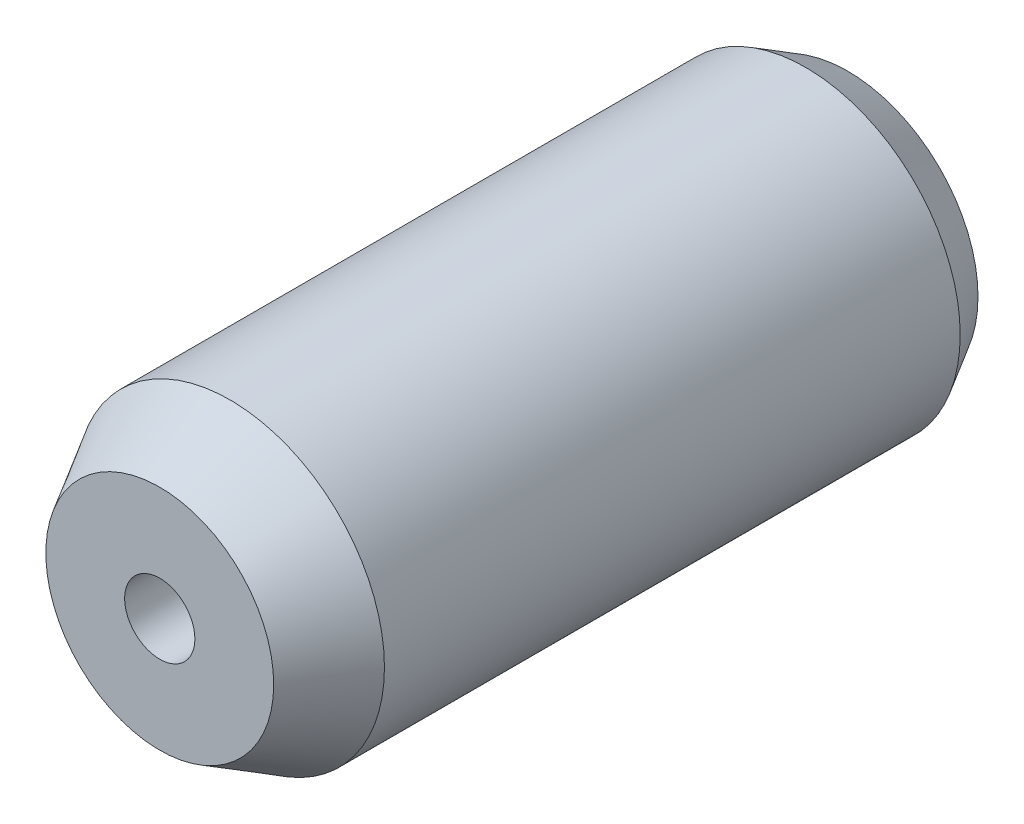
ISO-10303-21;
HEADER;
FILE_DESCRIPTION(('STEP AP214'),'2;1');
FILE_NAME('part.step','',(''),(''),'','','');
FILE_SCHEMA(('AUTOMOTIVE_DESIGN { 1 0 10303 214 1 1 1 1 }'));
ENDSEC;
DATA;
#1=APPLICATION_CONTEXT('core data for automotive mechanical design processes');
#2=APPLICATION_PROTOCOL_DEFINITION('international standard','automotive_design',2000,#1);
#3=PRODUCT_CONTEXT('',#1,'mechanical');
#4=PRODUCT('Part','Part','',(#3));
#5=PRODUCT_RELATED_PRODUCT_CATEGORY('part','',(#4));
#6=PRODUCT_DEFINITION_FORMATION('','',#4);
#7=PRODUCT_DEFINITION_CONTEXT('part definition',#1,'design');
#8=PRODUCT_DEFINITION('design','',#6,#7);
#9=PRODUCT_DEFINITION_SHAPE('','',#8);
#10=(LENGTH_UNIT() NAMED_UNIT(*) SI_UNIT(.MILLI.,.METRE.));
#11=(NAMED_UNIT(*) PLANE_ANGLE_UNIT() SI_UNIT($,.RADIAN.));
#12=(NAMED_UNIT(*) SI_UNIT($,.STERADIAN.) SOLID_ANGLE_UNIT());
#13=UNCERTAINTY_MEASURE_WITH_UNIT(LENGTH_MEASURE(1.E-05),#10,'distance_accuracy_value','');
#14=(GEOMETRIC_REPRESENTATION_CONTEXT(3) GLOBAL_UNCERTAINTY_ASSIGNED_CONTEXT((#13)) GLOBAL_UNIT_ASSIGNED_CONTEXT((#10,
#11,#12)) REPRESENTATION_CONTEXT('',''));
#15=CARTESIAN_POINT('',(0.,0.,0.));
#16=DIRECTION('',(0.,0.,1.));
#17=DIRECTION('',(1.,0.,0.));
#18=AXIS2_PLACEMENT_3D('',#15,#16,#17);
#19=CARTESIAN_POINT('',(0.,0.,0.));
#20=DIRECTION('',(0.,0.,1.));
#21=DIRECTION('',(1.,0.,0.));
#22=AXIS2_PLACEMENT_3D('',#19,#20,#21);
#23=PLANE('',#22);
#24=CARTESIAN_POINT('',(0.,0.,0.));
#25=DIRECTION('',(0.,0.,1.));
#26=DIRECTION('',(1.,0.,0.));
#27=AXIS2_PLACEMENT_3D('',#24,#25,#26);
#28=CIRCLE('',#27,9.26794919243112);
#29=CARTESIAN_POINT('',(9.26794919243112,0.,0.));
#30=VERTEX_POINT('',#29);
#31=EDGE_CURVE('E8',#30,#30,#28,.T.);
#32=ORIENTED_EDGE('',*,*,#31,.F.);
#33=EDGE_LOOP('',(#32));
#34=FACE_BOUND('',#33,.T.);
#35=ADVANCED_FACE('F13',(#34),#23,.F.);
#36=CARTESIAN_POINT('',(0.,0.,3.));
#37=DIRECTION('',(0.,0.,1.));
#38=DIRECTION('',(1.,0.,0.));
#39=AXIS2_PLACEMENT_3D('',#36,#37,#38);
#40=CONICAL_SURFACE('',#39,11.,0.523598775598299);
#41=ORIENTED_EDGE('',*,*,#31,.T.);
#42=EDGE_LOOP('',(#41));
#43=FACE_BOUND('',#42,.T.);
#44=CARTESIAN_POINT('',(0.,0.,3.));
#45=DIRECTION('',(0.,0.,1.));
#46=DIRECTION('',(1.,0.,0.));
#47=AXIS2_PLACEMENT_3D('',#44,#45,#46);
#48=CIRCLE('',#47,11.);
#49=CARTESIAN_POINT('',(11.,0.,3.));
#50=VERTEX_POINT('',#49);
#51=EDGE_CURVE('E19',#50,#50,#48,.T.);
#52=ORIENTED_EDGE('',*,*,#51,.F.);
#53=EDGE_LOOP('',(#52));
#54=FACE_BOUND('',#53,.T.);
#55=ADVANCED_FACE('F61',(#43,#54),#40,.T.);
#56=CARTESIAN_POINT('',(0.,0.,50.));
#57=DIRECTION('',(0.,0.,1.));
#58=DIRECTION('',(1.,0.,0.));
#59=AXIS2_PLACEMENT_3D('',#56,#57,#58);
#60=CYLINDRICAL_SURFACE('',#59,11.);
#61=CARTESIAN_POINT('',(0.,0.,44.));
#62=DIRECTION('',(0.,0.,1.));
#63=DIRECTION('',(1.,0.,0.));
#64=AXIS2_PLACEMENT_3D('',#61,#62,#63);
#65=CIRCLE('',#64,11.);
#66=CARTESIAN_POINT('',(11.,0.,44.));
#67=VERTEX_POINT('',#66);
#68=EDGE_CURVE('E23',#67,#67,#65,.T.);
#69=ORIENTED_EDGE('',*,*,#68,.F.);
#70=EDGE_LOOP('',(#69));
#71=FACE_BOUND('',#70,.T.);
#72=ORIENTED_EDGE('',*,*,#51,.T.);
#73=EDGE_LOOP('',(#72));
#74=FACE_BOUND('',#73,.T.);
#75=ADVANCED_FACE('F56',(#71,#74),#60,.T.);
#76=CARTESIAN_POINT('',(0.,0.,44.));
#77=DIRECTION('',(0.,0.,-1.));
#78=DIRECTION('',(-1.,0.,0.));
#79=AXIS2_PLACEMENT_3D('',#76,#77,#78);
#80=CONICAL_SURFACE('',#79,11.,0.523598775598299);
#81=CARTESIAN_POINT('',(0.,0.,49.));
#82=DIRECTION('',(0.,0.,1.));
#83=DIRECTION('',(1.,0.,0.));
#84=AXIS2_PLACEMENT_3D('',#81,#82,#83);
#85=CIRCLE('',#84,8.11324865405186);
#86=CARTESIAN_POINT('',(8.11324865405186,0.,49.));
#87=VERTEX_POINT('',#86);
#88=EDGE_CURVE('E27',#87,#87,#85,.T.);
#89=ORIENTED_EDGE('',*,*,#88,.F.);
#90=EDGE_LOOP('',(#89));
#91=FACE_BOUND('',#90,.T.);
#92=ORIENTED_EDGE('',*,*,#68,.T.);
#93=EDGE_LOOP('',(#92));
#94=FACE_BOUND('',#93,.T.);
#95=ADVANCED_FACE('F50',(#91,#94),#80,.T.);
#96=CARTESIAN_POINT('',(8.11324865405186,0.,49.));
#97=DIRECTION('',(0.,0.,-1.));
#98=DIRECTION('',(-1.,0.,0.));
#99=AXIS2_PLACEMENT_3D('',#96,#97,#98);
#100=PLANE('',#99);
#101=CARTESIAN_POINT('',(0.,0.,49.));
#102=DIRECTION('',(0.,0.,1.));
#103=DIRECTION('',(1.,0.,0.));
#104=AXIS2_PLACEMENT_3D('',#101,#102,#103);
#105=CIRCLE('',#104,2.5);
#106=CARTESIAN_POINT('',(2.5,0.,49.));
#107=VERTEX_POINT('',#106);
#108=EDGE_CURVE('E32',#107,#107,#105,.T.);
#109=ORIENTED_EDGE('',*,*,#108,.F.);
#110=EDGE_LOOP('',(#109));
#111=FACE_BOUND('',#110,.T.);
#112=ORIENTED_EDGE('',*,*,#88,.T.);
#113=EDGE_LOOP('',(#112));
#114=FACE_BOUND('',#113,.T.);
#115=ADVANCED_FACE('F44',(#111,#114),#100,.F.);
#116=CARTESIAN_POINT('',(0.,0.,50.));
#117=DIRECTION('',(0.,0.,1.));
#118=DIRECTION('',(1.,0.,0.));
#119=AXIS2_PLACEMENT_3D('',#116,#117,#118);
#120=CYLINDRICAL_SURFACE('',#119,2.5);
#121=CARTESIAN_POINT('',(0.,0.,39.));
#122=DIRECTION('',(0.,0.,1.));
#123=DIRECTION('',(1.,0.,0.));
#124=AXIS2_PLACEMENT_3D('',#121,#122,#123);
#125=CIRCLE('',#124,2.5);
#126=CARTESIAN_POINT('',(2.5,0.,39.));
#127=VERTEX_POINT('',#126);
#128=EDGE_CURVE('E35',#127,#127,#125,.T.);
#129=ORIENTED_EDGE('',*,*,#128,.F.);
#130=EDGE_LOOP('',(#129));
#131=FACE_BOUND('',#130,.T.);
#132=ORIENTED_EDGE('',*,*,#108,.T.);
#133=EDGE_LOOP('',(#132));
#134=FACE_BOUND('',#133,.T.);
#135=ADVANCED_FACE('F41',(#131,#134),#120,.F.);
#136=CARTESIAN_POINT('',(0.,0.,39.));
#137=DIRECTION('',(0.,0.,1.));
#138=DIRECTION('',(1.,0.,0.));
#139=AXIS2_PLACEMENT_3D('',#136,#137,#138);
#140=PLANE('',#139);
#141=ORIENTED_EDGE('',*,*,#128,.T.);
#142=EDGE_LOOP('',(#141));
#143=FACE_BOUND('',#142,.T.);
#144=ADVANCED_FACE('F39',(#143),#140,.T.);
#145=CLOSED_SHELL('',(#35,#55,#75,#95,#115,#135,#144));
#146=MANIFOLD_SOLID_BREP('B1',#145);
#147=ADVANCED_BREP_SHAPE_REPRESENTATION('',(#18,#146),#14);
#148=SHAPE_DEFINITION_REPRESENTATION(#9,#147);
ENDSEC;
END-ISO-10303-21;
